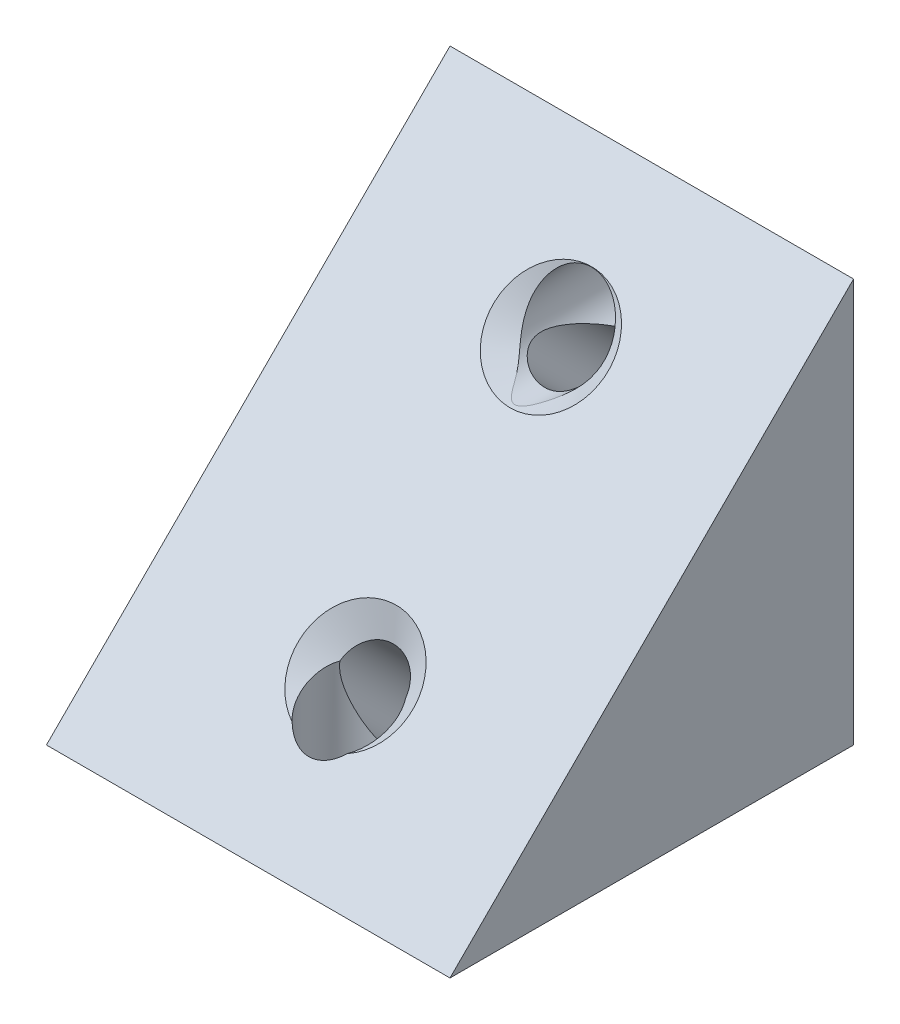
ISO-10303-21;
HEADER;
FILE_DESCRIPTION(('STEP AP214'),'2;1');
FILE_NAME('part.step','',(''),(''),'','','');
FILE_SCHEMA(('AUTOMOTIVE_DESIGN { 1 0 10303 214 1 1 1 1 }'));
ENDSEC;
DATA;
#1=APPLICATION_CONTEXT('core data for automotive mechanical design processes');
#2=APPLICATION_PROTOCOL_DEFINITION('international standard','automotive_design',2000,#1);
#3=PRODUCT_CONTEXT('',#1,'mechanical');
#4=PRODUCT('Part','Part','',(#3));
#5=PRODUCT_RELATED_PRODUCT_CATEGORY('part','',(#4));
#6=PRODUCT_DEFINITION_FORMATION('','',#4);
#7=PRODUCT_DEFINITION_CONTEXT('part definition',#1,'design');
#8=PRODUCT_DEFINITION('design','',#6,#7);
#9=PRODUCT_DEFINITION_SHAPE('','',#8);
#10=(LENGTH_UNIT() NAMED_UNIT(*) SI_UNIT(.MILLI.,.METRE.));
#11=(NAMED_UNIT(*) PLANE_ANGLE_UNIT() SI_UNIT($,.RADIAN.));
#12=(NAMED_UNIT(*) SI_UNIT($,.STERADIAN.) SOLID_ANGLE_UNIT());
#13=UNCERTAINTY_MEASURE_WITH_UNIT(LENGTH_MEASURE(1.E-05),#10,'distance_accuracy_value','');
#14=(GEOMETRIC_REPRESENTATION_CONTEXT(3) GLOBAL_UNCERTAINTY_ASSIGNED_CONTEXT((#13)) GLOBAL_UNIT_ASSIGNED_CONTEXT((#10,
#11,#12)) REPRESENTATION_CONTEXT('',''));
#15=CARTESIAN_POINT('',(0.,0.,0.));
#16=DIRECTION('',(0.,0.,1.));
#17=DIRECTION('',(1.,0.,0.));
#18=AXIS2_PLACEMENT_3D('',#15,#16,#17);
#19=CARTESIAN_POINT('',(-33.7186524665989,20.,20.));
#20=DIRECTION('',(1.,0.,0.));
#21=DIRECTION('',(0.,0.,-1.));
#22=AXIS2_PLACEMENT_3D('',#19,#20,#21);
#23=PLANE('',#22);
#24=DIRECTION('',(0.,0.,-1.));
#25=VECTOR('',#24,1.);
#26=CARTESIAN_POINT('',(-33.7186524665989,0.,20.));
#27=LINE('',#26,#25);
#28=CARTESIAN_POINT('',(-33.7186524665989,0.,20.));
#29=VERTEX_POINT('',#28);
#30=CARTESIAN_POINT('',(-33.7186524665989,0.,0.));
#31=VERTEX_POINT('',#30);
#32=EDGE_CURVE('E89',#29,#31,#27,.T.);
#33=ORIENTED_EDGE('',*,*,#32,.F.);
#34=DIRECTION('',(0.,0.707106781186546,-0.707106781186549));
#35=VECTOR('',#34,1.);
#36=CARTESIAN_POINT('',(-33.7186524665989,0.,20.));
#37=LINE('',#36,#35);
#38=CARTESIAN_POINT('',(-33.7186524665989,20.,0.));
#39=VERTEX_POINT('',#38);
#40=EDGE_CURVE('E85',#29,#39,#37,.T.);
#41=ORIENTED_EDGE('',*,*,#40,.T.);
#42=DIRECTION('',(0.,-1.,0.));
#43=VECTOR('',#42,1.);
#44=CARTESIAN_POINT('',(-33.7186524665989,20.,0.));
#45=LINE('',#44,#43);
#46=EDGE_CURVE('E87',#39,#31,#45,.T.);
#47=ORIENTED_EDGE('',*,*,#46,.T.);
#48=EDGE_LOOP('',(#33,#41,#47));
#49=FACE_BOUND('',#48,.T.);
#50=ADVANCED_FACE('F35',(#49),#23,.F.);
#51=CARTESIAN_POINT('',(-33.7186524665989,0.,20.));
#52=DIRECTION('',(0.,1.,0.));
#53=DIRECTION('',(0.,0.,1.));
#54=AXIS2_PLACEMENT_3D('',#51,#52,#53);
#55=PLANE('',#54);
#56=CARTESIAN_POINT('',(-23.7186524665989,0.,9.36909637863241));
#57=DIRECTION('',(0.,1.,0.));
#58=DIRECTION('',(0.,0.,1.));
#59=AXIS2_PLACEMENT_3D('',#56,#57,#58);
#60=ELLIPSE('',#59,2.30792582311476,1.63194999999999);
#61=CARTESIAN_POINT('',(-23.7186524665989,0.,11.6770222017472));
#62=VERTEX_POINT('',#61);
#63=EDGE_CURVE('E183',#62,#62,#60,.T.);
#64=ORIENTED_EDGE('',*,*,#63,.T.);
#65=EDGE_LOOP('',(#64));
#66=FACE_BOUND('',#65,.T.);
#67=CARTESIAN_POINT('',(-23.7186524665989,0.,15.));
#68=DIRECTION('',(0.,-1.,0.));
#69=DIRECTION('',(0.,0.,-1.));
#70=AXIS2_PLACEMENT_3D('',#67,#68,#69);
#71=CIRCLE('',#70,2.);
#72=CARTESIAN_POINT('',(-23.7186524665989,0.,13.));
#73=VERTEX_POINT('',#72);
#74=EDGE_CURVE('E115',#73,#73,#71,.T.);
#75=ORIENTED_EDGE('',*,*,#74,.F.);
#76=EDGE_LOOP('',(#75));
#77=FACE_BOUND('',#76,.T.);
#78=DIRECTION('',(1.,0.,0.));
#79=VECTOR('',#78,1.);
#80=CARTESIAN_POINT('',(-33.7186524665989,0.,0.));
#81=LINE('',#80,#79);
#82=CARTESIAN_POINT('',(-13.7186524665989,0.,0.));
#83=VERTEX_POINT('',#82);
#84=EDGE_CURVE('E100',#31,#83,#81,.T.);
#85=ORIENTED_EDGE('',*,*,#84,.T.);
#86=DIRECTION('',(0.,0.,-1.));
#87=VECTOR('',#86,1.);
#88=CARTESIAN_POINT('',(-13.7186524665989,0.,20.));
#89=LINE('',#88,#87);
#90=CARTESIAN_POINT('',(-13.7186524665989,0.,20.));
#91=VERTEX_POINT('',#90);
#92=EDGE_CURVE('E106',#91,#83,#89,.T.);
#93=ORIENTED_EDGE('',*,*,#92,.F.);
#94=DIRECTION('',(1.,0.,0.));
#95=VECTOR('',#94,1.);
#96=CARTESIAN_POINT('',(-33.7186524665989,0.,20.));
#97=LINE('',#96,#95);
#98=EDGE_CURVE('E103',#29,#91,#97,.T.);
#99=ORIENTED_EDGE('',*,*,#98,.F.);
#100=ORIENTED_EDGE('',*,*,#32,.T.);
#101=EDGE_LOOP('',(#85,#93,#99,#100));
#102=FACE_BOUND('',#101,.T.);
#103=ADVANCED_FACE('F160',(#66,#77,#102),#55,.F.);
#104=CARTESIAN_POINT('',(-13.7186524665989,20.,20.));
#105=DIRECTION('',(-1.,0.,0.));
#106=DIRECTION('',(0.,-1.,0.));
#107=AXIS2_PLACEMENT_3D('',#104,#105,#106);
#108=PLANE('',#107);
#109=DIRECTION('',(0.,1.,0.));
#110=VECTOR('',#109,1.);
#111=CARTESIAN_POINT('',(-13.7186524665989,20.,0.));
#112=LINE('',#111,#110);
#113=CARTESIAN_POINT('',(-13.7186524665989,20.,0.));
#114=VERTEX_POINT('',#113);
#115=EDGE_CURVE('E104',#83,#114,#112,.T.);
#116=ORIENTED_EDGE('',*,*,#115,.T.);
#117=DIRECTION('',(0.,-0.707106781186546,0.707106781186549));
#118=VECTOR('',#117,1.);
#119=CARTESIAN_POINT('',(-13.7186524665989,0.,20.));
#120=LINE('',#119,#118);
#121=EDGE_CURVE('E66',#114,#91,#120,.T.);
#122=ORIENTED_EDGE('',*,*,#121,.T.);
#123=ORIENTED_EDGE('',*,*,#92,.T.);
#124=EDGE_LOOP('',(#116,#122,#123));
#125=FACE_BOUND('',#124,.T.);
#126=ADVANCED_FACE('F164',(#125),#108,.F.);
#127=CARTESIAN_POINT('',(0.,0.,0.));
#128=DIRECTION('',(0.,0.,1.));
#129=DIRECTION('',(1.,0.,0.));
#130=AXIS2_PLACEMENT_3D('',#127,#128,#129);
#131=PLANE('',#130);
#132=CARTESIAN_POINT('',(-23.7186524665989,10.,0.));
#133=DIRECTION('',(0.,0.,1.));
#134=DIRECTION('',(0.,1.,0.));
#135=AXIS2_PLACEMENT_3D('',#132,#133,#134);
#136=ELLIPSE('',#135,2.30792582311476,1.63194999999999);
#137=CARTESIAN_POINT('',(-23.7186524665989,12.3079258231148,0.));
#138=VERTEX_POINT('',#137);
#139=EDGE_CURVE('E178',#138,#138,#136,.T.);
#140=ORIENTED_EDGE('',*,*,#139,.T.);
#141=EDGE_LOOP('',(#140));
#142=FACE_BOUND('',#141,.T.);
#143=CARTESIAN_POINT('',(-23.7186524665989,15.,0.));
#144=DIRECTION('',(0.,0.,-1.));
#145=DIRECTION('',(-1.,0.,0.));
#146=AXIS2_PLACEMENT_3D('',#143,#144,#145);
#147=CIRCLE('',#146,2.);
#148=CARTESIAN_POINT('',(-25.7186524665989,15.,0.));
#149=VERTEX_POINT('',#148);
#150=EDGE_CURVE('E181',#149,#149,#147,.T.);
#151=ORIENTED_EDGE('',*,*,#150,.F.);
#152=EDGE_LOOP('',(#151));
#153=FACE_BOUND('',#152,.T.);
#154=ORIENTED_EDGE('',*,*,#46,.F.);
#155=DIRECTION('',(-1.,0.,0.));
#156=VECTOR('',#155,1.);
#157=CARTESIAN_POINT('',(-33.7186524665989,20.,0.));
#158=LINE('',#157,#156);
#159=EDGE_CURVE('E99',#114,#39,#158,.T.);
#160=ORIENTED_EDGE('',*,*,#159,.F.);
#161=ORIENTED_EDGE('',*,*,#115,.F.);
#162=ORIENTED_EDGE('',*,*,#84,.F.);
#163=EDGE_LOOP('',(#154,#160,#161,#162));
#164=FACE_BOUND('',#163,.T.);
#165=ADVANCED_FACE('F97',(#142,#153,#164),#131,.F.);
#166=CARTESIAN_POINT('',(0.,0.,20.));
#167=DIRECTION('',(0.,0.707106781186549,0.707106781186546));
#168=DIRECTION('',(1.,0.,0.));
#169=AXIS2_PLACEMENT_3D('',#166,#167,#168);
#170=PLANE('',#169);
#171=CARTESIAN_POINT('',(-23.7186524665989,15.,4.99999999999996));
#172=DIRECTION('',(0.,0.707106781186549,0.707106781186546));
#173=DIRECTION('',(0.,-0.707106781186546,0.707106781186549));
#174=AXIS2_PLACEMENT_3D('',#171,#172,#173);
#175=CIRCLE('',#174,2.8575);
#176=CARTESIAN_POINT('',(-23.7186524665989,12.9794423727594,7.02055762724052));
#177=VERTEX_POINT('',#176);
#178=EDGE_CURVE('E149',#177,#177,#175,.T.);
#179=ORIENTED_EDGE('',*,*,#178,.F.);
#180=EDGE_LOOP('',(#179));
#181=FACE_BOUND('',#180,.T.);
#182=CARTESIAN_POINT('',(-23.7186524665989,5.3154518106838,14.6845481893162));
#183=DIRECTION('',(0.,0.707106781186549,0.707106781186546));
#184=DIRECTION('',(0.,-0.707106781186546,0.707106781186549));
#185=AXIS2_PLACEMENT_3D('',#182,#183,#184);
#186=CIRCLE('',#185,2.8575);
#187=CARTESIAN_POINT('',(-22.349830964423,3.54180670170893,16.4581932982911));
#188=VERTEX_POINT('',#187);
#189=CARTESIAN_POINT('',(-25.0874739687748,3.54180670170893,16.4581932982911));
#190=VERTEX_POINT('',#189);
#191=EDGE_CURVE('E57',#188,#190,#186,.T.);
#192=ORIENTED_EDGE('',*,*,#191,.F.);
#193=CARTESIAN_POINT('',(-23.7186524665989,4.99999999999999,15.));
#194=DIRECTION('',(0.,0.707106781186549,0.707106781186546));
#195=DIRECTION('',(0.,-0.707106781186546,0.707106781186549));
#196=AXIS2_PLACEMENT_3D('',#193,#194,#195);
#197=ELLIPSE('',#196,2.82842712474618,2.);
#198=EDGE_CURVE('E101',#190,#188,#197,.T.);
#199=ORIENTED_EDGE('',*,*,#198,.F.);
#200=EDGE_LOOP('',(#192,#199));
#201=FACE_BOUND('',#200,.T.);
#202=ORIENTED_EDGE('',*,*,#121,.F.);
#203=ORIENTED_EDGE('',*,*,#159,.T.);
#204=ORIENTED_EDGE('',*,*,#40,.F.);
#205=ORIENTED_EDGE('',*,*,#98,.T.);
#206=EDGE_LOOP('',(#202,#203,#204,#205));
#207=FACE_BOUND('',#206,.T.);
#208=ADVANCED_FACE('F37',(#181,#201,#207),#170,.T.);
#209=CARTESIAN_POINT('',(-23.7186524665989,10.,15.));
#210=DIRECTION('',(0.,-1.,0.));
#211=DIRECTION('',(0.,0.,-1.));
#212=AXIS2_PLACEMENT_3D('',#209,#210,#211);
#213=CYLINDRICAL_SURFACE('',#212,2.);
#214=ORIENTED_EDGE('',*,*,#198,.T.);
#215=CARTESIAN_POINT('',(-22.6736969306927,3.41779445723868,16.7053058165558));
#216=CARTESIAN_POINT('',(-22.624458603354,3.43297603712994,16.6751345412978));
#217=CARTESIAN_POINT('',(-22.5767835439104,3.44913908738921,16.6429862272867));
#218=CARTESIAN_POINT('',(-22.4848009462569,3.4832394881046,16.5750803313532));
#219=CARTESIAN_POINT('',(-22.4404913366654,3.50117573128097,16.5393250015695));
#220=CARTESIAN_POINT('',(-22.3132880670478,3.55721334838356,16.4274613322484));
#221=CARTESIAN_POINT('',(-22.2356472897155,3.59769162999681,16.3464617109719));
#222=CARTESIAN_POINT('',(-22.0960817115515,3.68327373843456,16.1745297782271));
#223=CARTESIAN_POINT('',(-22.0341229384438,3.72836726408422,16.0836195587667));
#224=CARTESIAN_POINT('',(-21.9263294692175,3.82184827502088,15.8941308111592));
#225=CARTESIAN_POINT('',(-21.8805120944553,3.87023923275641,15.7955441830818));
#226=CARTESIAN_POINT('',(-21.8020082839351,3.9735387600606,15.583476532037));
#227=CARTESIAN_POINT('',(-21.77097992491,4.02863012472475,15.4694697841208));
#228=CARTESIAN_POINT('',(-21.7293636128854,4.13914302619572,15.2378738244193));
#229=CARTESIAN_POINT('',(-21.7187879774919,4.19456474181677,15.1202824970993));
#230=CARTESIAN_POINT('',(-21.7185123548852,4.30652598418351,14.8779466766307));
#231=CARTESIAN_POINT('',(-21.7299498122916,4.3629687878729,14.7531537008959));
#232=CARTESIAN_POINT('',(-21.7765957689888,4.47082588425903,14.505812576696));
#233=CARTESIAN_POINT('',(-21.8117829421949,4.52224464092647,14.3832625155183));
#234=CARTESIAN_POINT('',(-21.8934450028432,4.60274076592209,14.1770013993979));
#235=CARTESIAN_POINT('',(-21.934159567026,4.63407440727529,14.0918729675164));
#236=CARTESIAN_POINT('',(-22.0285299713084,4.68917396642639,13.9264489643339));
#237=CARTESIAN_POINT('',(-22.0821656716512,4.71295152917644,13.8461461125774));
#238=CARTESIAN_POINT('',(-22.1868041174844,4.74457788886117,13.7120810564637));
#239=CARTESIAN_POINT('',(-22.2350314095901,4.75493602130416,13.6567490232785));
#240=CARTESIAN_POINT('',(-22.3378571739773,4.76715166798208,13.5512769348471));
#241=CARTESIAN_POINT('',(-22.3924465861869,4.76902112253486,13.5011296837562));
#242=CARTESIAN_POINT('',(-22.4966950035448,4.7624325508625,13.415524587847));
#243=CARTESIAN_POINT('',(-22.5455967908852,4.75568872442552,13.3790219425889));
#244=CARTESIAN_POINT('',(-22.6451340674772,4.73350113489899,13.3114607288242));
#245=CARTESIAN_POINT('',(-22.6957674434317,4.71806764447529,13.2803957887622));
#246=CARTESIAN_POINT('',(-22.7968266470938,4.67806049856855,13.2241643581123));
#247=CARTESIAN_POINT('',(-22.8472519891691,4.65347167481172,13.1990077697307));
#248=CARTESIAN_POINT('',(-22.945829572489,4.59587308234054,13.1545515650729));
#249=CARTESIAN_POINT('',(-22.9939795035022,4.56285496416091,13.1352577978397));
#250=CARTESIAN_POINT('',(-23.1019428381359,4.47791902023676,13.0963254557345));
#251=CARTESIAN_POINT('',(-23.1603699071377,4.4233587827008,13.0786691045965));
#252=CARTESIAN_POINT('',(-23.2701059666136,4.30599858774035,13.0501172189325));
#253=CARTESIAN_POINT('',(-23.3213988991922,4.24318064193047,13.0392367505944));
#254=CARTESIAN_POINT('',(-23.4018328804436,4.13376293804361,13.0249829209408));
#255=CARTESIAN_POINT('',(-23.4327324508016,4.08857785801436,13.0203181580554));
#256=CARTESIAN_POINT('',(-23.4920194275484,3.99644888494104,13.0126565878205));
#257=CARTESIAN_POINT('',(-23.5204064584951,3.94950473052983,13.0096600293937));
#258=CARTESIAN_POINT('',(-23.5692630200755,3.86456313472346,13.005470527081));
#259=CARTESIAN_POINT('',(-23.5901269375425,3.82680080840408,13.0040288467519));
#260=CARTESIAN_POINT('',(-23.6230944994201,3.76562470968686,13.0022448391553));
#261=CARTESIAN_POINT('',(-23.6354464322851,3.74234822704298,13.0016930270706));
#262=CARTESIAN_POINT('',(-23.6554360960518,3.70495220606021,13.0009849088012));
#263=CARTESIAN_POINT('',(-23.6630283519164,3.6908114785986,13.0007583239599));
#264=CARTESIAN_POINT('',(-23.6756828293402,3.66822028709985,13.0004558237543));
#265=CARTESIAN_POINT('',(-23.6805889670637,3.6596825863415,13.0003555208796));
#266=CARTESIAN_POINT('',(-23.6890483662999,3.64611731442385,13.0002164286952));
#267=CARTESIAN_POINT('',(-23.6924130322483,3.64098153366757,13.0001687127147));
#268=CARTESIAN_POINT('',(-23.6979533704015,3.63359893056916,13.0001062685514));
#269=CARTESIAN_POINT('',(-23.6998964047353,3.63117715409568,13.0000868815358));
#270=CARTESIAN_POINT('',(-23.704074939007,3.62659775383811,13.0000520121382));
#271=CARTESIAN_POINT('',(-23.7063078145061,3.62443806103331,13.0000364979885));
#272=CARTESIAN_POINT('',(-23.7096139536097,3.62209072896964,13.0000202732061));
#273=CARTESIAN_POINT('',(-23.7104373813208,3.62156377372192,13.0000166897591));
#274=CARTESIAN_POINT('',(-23.7121489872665,3.6206276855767,13.0000103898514));
#275=CARTESIAN_POINT('',(-23.7130370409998,3.62021833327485,13.0000076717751));
#276=CARTESIAN_POINT('',(-23.7146873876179,3.61963083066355,13.0000037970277));
#277=CARTESIAN_POINT('',(-23.7154387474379,3.61942265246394,13.0000024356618));
#278=CARTESIAN_POINT('',(-23.7169659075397,3.61913613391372,13.0000005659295));
#279=CARTESIAN_POINT('',(-23.7177416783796,3.61905764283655,13.0000000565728));
#280=CARTESIAN_POINT('',(-23.7192967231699,3.61904160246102,12.9999999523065));
#281=CARTESIAN_POINT('',(-23.7200760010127,3.61910441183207,13.0000003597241));
#282=CARTESIAN_POINT('',(-23.7216122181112,3.61936239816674,13.0000020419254));
#283=CARTESIAN_POINT('',(-23.7223691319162,3.61955772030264,13.0000033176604));
#284=CARTESIAN_POINT('',(-23.7241447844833,3.62015809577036,13.0000072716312));
#285=CARTESIAN_POINT('',(-23.7251452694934,3.62061607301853,13.0000103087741));
#286=CARTESIAN_POINT('',(-23.7270652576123,3.6216782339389,13.0000174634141));
#287=CARTESIAN_POINT('',(-23.7279844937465,3.62228287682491,13.0000215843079));
#288=CARTESIAN_POINT('',(-23.7313192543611,3.62473191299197,13.0000385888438));
#289=CARTESIAN_POINT('',(-23.7335056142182,3.62687754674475,13.0000540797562));
#290=CARTESIAN_POINT('',(-23.7376056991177,3.63141698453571,13.0000887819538));
#291=CARTESIAN_POINT('',(-23.7395169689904,3.63381272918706,13.0001080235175));
#292=CARTESIAN_POINT('',(-23.7454628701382,3.6417590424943,13.0001754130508));
#293=CARTESIAN_POINT('',(-23.7491916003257,3.64753778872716,13.0002298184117));
#294=CARTESIAN_POINT('',(-23.756386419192,3.659257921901,13.0003528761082));
#295=CARTESIAN_POINT('',(-23.7598518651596,3.66519966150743,13.0004215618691));
#296=CARTESIAN_POINT('',(-23.7700384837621,3.68309241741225,13.0006485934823));
#297=CARTESIAN_POINT('',(-23.7765747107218,3.69515054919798,13.0008282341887));
#298=CARTESIAN_POINT('',(-23.792622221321,3.72500914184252,13.001345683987));
#299=CARTESIAN_POINT('',(-23.8020820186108,3.74283442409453,13.001718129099));
#300=CARTESIAN_POINT('',(-23.8211017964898,3.77843845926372,13.0026030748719));
#301=CARTESIAN_POINT('',(-23.8306618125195,3.79621719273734,13.0031156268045));
#302=CARTESIAN_POINT('',(-23.8596672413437,3.84941942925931,13.0048831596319));
#303=CARTESIAN_POINT('',(-23.8794180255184,3.88467015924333,13.0063674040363));
#304=CARTESIAN_POINT('',(-23.9262143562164,3.96501113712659,13.0106220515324));
#305=CARTESIAN_POINT('',(-23.9536614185,4.00985753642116,13.0136455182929));
#306=CARTESIAN_POINT('',(-24.0109119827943,4.09792002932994,13.0212582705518));
#307=CARTESIAN_POINT('',(-24.0407162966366,4.14113555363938,13.0258480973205));
#308=CARTESIAN_POINT('',(-24.1029330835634,4.22526155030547,13.0370111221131));
#309=CARTESIAN_POINT('',(-24.1353398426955,4.26617675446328,13.0435800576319));
#310=CARTESIAN_POINT('',(-24.2030281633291,4.34503108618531,13.0592305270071));
#311=CARTESIAN_POINT('',(-24.2383082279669,4.38297174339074,13.0683107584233));
#312=CARTESIAN_POINT('',(-24.3197871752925,4.46275207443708,13.0919109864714));
#313=CARTESIAN_POINT('',(-24.3666989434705,4.50366507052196,13.1071821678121));
#314=CARTESIAN_POINT('',(-24.4642704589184,4.57772905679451,13.1434579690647));
#315=CARTESIAN_POINT('',(-24.5149247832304,4.61089099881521,13.1644544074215));
#316=CARTESIAN_POINT('',(-24.6187728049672,4.66804680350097,13.2130806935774));
#317=CARTESIAN_POINT('',(-24.6719814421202,4.69197671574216,13.2407547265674));
#318=CARTESIAN_POINT('',(-24.7782097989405,4.72976381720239,13.3026155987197));
#319=CARTESIAN_POINT('',(-24.8312294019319,4.74361559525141,13.3368059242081));
#320=CARTESIAN_POINT('',(-24.9307560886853,4.76129295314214,13.4080623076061));
#321=CARTESIAN_POINT('',(-24.9774505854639,4.76580697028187,13.4447057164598));
#322=CARTESIAN_POINT('',(-25.0674628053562,4.7680942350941,13.5220817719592));
#323=CARTESIAN_POINT('',(-25.110778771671,4.76586399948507,13.5628165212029));
#324=CARTESIAN_POINT('',(-25.2137265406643,4.75348563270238,13.6686241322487));
#325=CARTESIAN_POINT('',(-25.2708291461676,4.73996631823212,13.7357681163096));
#326=CARTESIAN_POINT('',(-25.3748700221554,4.70435499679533,13.8754651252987));
#327=CARTESIAN_POINT('',(-25.4217844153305,4.68224318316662,13.9480303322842));
#328=CARTESIAN_POINT('',(-25.5181647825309,4.62428107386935,14.1200852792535));
#329=CARTESIAN_POINT('',(-25.5639060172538,4.58629678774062,14.2209431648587));
#330=CARTESIAN_POINT('',(-25.6377478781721,4.5041081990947,14.4264013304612));
#331=CARTESIAN_POINT('',(-25.6658394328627,4.45990071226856,14.5310035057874));
#332=CARTESIAN_POINT('',(-25.7051020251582,4.36716253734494,14.7433890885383));
#333=CARTESIAN_POINT('',(-25.7160078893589,4.31857610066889,14.8511966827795));
#334=CARTESIAN_POINT('',(-25.7204468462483,4.2196931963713,15.0663360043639));
#335=CARTESIAN_POINT('',(-25.7139803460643,4.16939676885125,15.1736677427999));
#336=CARTESIAN_POINT('',(-25.6819427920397,4.06181502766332,15.4004002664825));
#337=CARTESIAN_POINT('',(-25.6538853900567,4.00451250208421,15.5194495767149));
#338=CARTESIAN_POINT('',(-25.5761597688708,3.89185772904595,15.751424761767));
#339=CARTESIAN_POINT('',(-25.5264714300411,3.83650734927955,15.8643448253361));
#340=CARTESIAN_POINT('',(-25.4057023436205,3.7294966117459,16.0813922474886));
#341=CARTESIAN_POINT('',(-25.33446607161,3.67786657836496,16.1854483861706));
#342=CARTESIAN_POINT('',(-25.1719602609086,3.5810625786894,16.3797990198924));
#343=CARTESIAN_POINT('',(-25.0807482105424,3.53587068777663,16.4701317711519));
#344=CARTESIAN_POINT('',(-24.9465199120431,3.48110254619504,16.5793345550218));
#345=CARTESIAN_POINT('',(-24.9112856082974,3.46765874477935,16.6061140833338));
#346=CARTESIAN_POINT('',(-24.8388811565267,3.44188057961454,16.6574223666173));
#347=CARTESIAN_POINT('',(-24.8017127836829,3.42954522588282,16.6819531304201));
#348=CARTESIAN_POINT('',(-24.7636080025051,3.41779445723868,16.7053058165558));
#349=B_SPLINE_CURVE_WITH_KNOTS('',3,(#215,#216,#217,#218,#219,#220,#221,#222,#223,#224,#225,
#226,#227,#228,#229,#230,#231,#232,#233,#234,#235,#236,#237,#238,#239,#240,#241,#242,#243,#244,
#245,#246,#247,#248,#249,#250,#251,#252,#253,#254,#255,#256,#257,#258,#259,#260,#261,#262,#263,
#264,#265,#266,#267,#268,#269,#270,#271,#272,#273,#274,#275,#276,#277,#278,#279,#280,#281,#282,
#283,#284,#285,#286,#287,#288,#289,#290,#291,#292,#293,#294,#295,#296,#297,#298,#299,#300,#301,
#302,#303,#304,#305,#306,#307,#308,#309,#310,#311,#312,#313,#314,#315,#316,#317,#318,#319,#320,
#321,#322,#323,#324,#325,#326,#327,#328,#329,#330,#331,#332,#333,#334,#335,#336,#337,#338,#339,
#340,#341,#342,#343,#344,#345,#346,#347,#348),.UNSPECIFIED.,.F.,.F.,(4,2,2,2,2,2,2,2,2,2,2,2,2,
2,2,2,2,2,2,2,2,2,2,2,2,2,2,2,2,2,2,2,2,2,2,2,2,2,2,2,2,2,2,2,2,2,2,2,2,2,2,2,2,2,2,2,2,2,2,2,2,
2,2,2,2,2,4),(0.,0.178993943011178,0.357876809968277,0.713938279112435,1.0692216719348,
1.42488516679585,1.81429002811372,2.20392933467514,2.61424305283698,3.0241888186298,
3.32146410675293,3.61827900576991,3.83989779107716,4.06120474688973,4.24460275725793,
4.42778441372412,4.61127092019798,4.79493988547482,5.03914423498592,5.28388965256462,
5.44859381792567,5.61332255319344,5.74280145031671,5.8218730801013,5.87002207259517,
5.89956445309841,5.91795268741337,5.9272666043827,5.93650140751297,5.93942767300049,
5.94234844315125,5.94467795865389,5.94700476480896,5.94933748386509,5.95167276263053,
5.95495475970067,5.95824716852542,5.96736286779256,5.97655545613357,5.99714720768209,
6.01778771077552,6.05892868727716,6.11948236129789,6.18005822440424,6.30134091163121,
6.45925494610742,6.61722360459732,6.77485444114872,6.9324036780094,7.12396722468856,
7.31525844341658,7.50785191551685,7.70054871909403,7.87844332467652,8.0564298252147,
8.32246629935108,8.58911968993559,8.93850851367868,9.2880767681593,9.64298778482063,
9.99789048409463,10.4012182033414,10.8049218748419,11.2116118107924,11.6171463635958,
11.7558208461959,11.8943702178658),.UNSPECIFIED.);
#350=CARTESIAN_POINT('',(-22.0967021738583,4.71584259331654,13.8298387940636));
#351=VERTEX_POINT('',#350);
#352=EDGE_CURVE('E11',#188,#351,#349,.T.);
#353=ORIENTED_EDGE('',*,*,#352,.T.);
#354=CARTESIAN_POINT('',(-22.0967021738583,4.71584259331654,13.8298387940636));
#355=CARTESIAN_POINT('',(-22.0936194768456,4.68087088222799,13.8341198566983));
#356=CARTESIAN_POINT('',(-22.0913193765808,4.64572696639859,13.837334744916));
#357=CARTESIAN_POINT('',(-22.0880972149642,4.57529344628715,13.84185428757));
#358=CARTESIAN_POINT('',(-22.0871734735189,4.54000407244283,13.8431612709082));
#359=CARTESIAN_POINT('',(-22.0861822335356,4.43446607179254,13.8445590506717));
#360=CARTESIAN_POINT('',(-22.0878657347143,4.3641683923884,13.8421677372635));
#361=CARTESIAN_POINT('',(-22.0947985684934,4.2248340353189,13.8324689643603));
#362=CARTESIAN_POINT('',(-22.1000138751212,4.15579172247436,13.825208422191));
#363=CARTESIAN_POINT('',(-22.1133345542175,4.01836686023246,13.8070702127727));
#364=CARTESIAN_POINT('',(-22.1214448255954,3.94998563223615,13.7961864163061));
#365=CARTESIAN_POINT('',(-22.1475720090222,3.76007704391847,13.7620734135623));
#366=CARTESIAN_POINT('',(-22.1683417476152,3.63946237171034,13.735903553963));
#367=CARTESIAN_POINT('',(-22.2169181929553,3.40091617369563,13.6785556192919));
#368=CARTESIAN_POINT('',(-22.2447264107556,3.28298522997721,13.6473764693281));
#369=CARTESIAN_POINT('',(-22.3077325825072,3.04893121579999,13.5817637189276));
#370=CARTESIAN_POINT('',(-22.3429888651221,2.93283068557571,13.5473056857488));
#371=CARTESIAN_POINT('',(-22.421488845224,2.70390914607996,13.4767919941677));
#372=CARTESIAN_POINT('',(-22.4647271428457,2.59108597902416,13.4407374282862));
#373=CARTESIAN_POINT('',(-22.5402313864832,2.41692868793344,13.3836747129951));
#374=CARTESIAN_POINT('',(-22.5693094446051,2.35416151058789,13.3628091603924));
#375=CARTESIAN_POINT('',(-22.6310251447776,2.23037767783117,13.321174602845));
#376=CARTESIAN_POINT('',(-22.6636616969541,2.16936049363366,13.3004055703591));
#377=CARTESIAN_POINT('',(-22.7328555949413,2.04993112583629,13.2593639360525));
#378=CARTESIAN_POINT('',(-22.7693881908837,1.99150548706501,13.2390891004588));
#379=CARTESIAN_POINT('',(-22.8472446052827,1.87770152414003,13.1992886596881));
#380=CARTESIAN_POINT('',(-22.8885639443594,1.82232042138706,13.1797623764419));
#381=CARTESIAN_POINT('',(-22.9700893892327,1.72413450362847,13.144926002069));
#382=CARTESIAN_POINT('',(-23.0094672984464,1.68071407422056,13.1294327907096));
#383=CARTESIAN_POINT('',(-23.0931335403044,1.59807217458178,13.0998159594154));
#384=CARTESIAN_POINT('',(-23.1374321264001,1.55885982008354,13.0856953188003));
#385=CARTESIAN_POINT('',(-23.2322092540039,1.4861559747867,13.0594252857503));
#386=CARTESIAN_POINT('',(-23.2827667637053,1.45275382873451,13.0473068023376));
#387=CARTESIAN_POINT('',(-23.3896623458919,1.39554639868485,13.0265035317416));
#388=CARTESIAN_POINT('',(-23.4459735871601,1.371698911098,13.017803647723));
#389=CARTESIAN_POINT('',(-23.5424953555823,1.34322507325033,13.0074049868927));
#390=CARTESIAN_POINT('',(-23.5814317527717,1.334791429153,13.0043211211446));
#391=CARTESIAN_POINT('',(-23.6602684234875,1.32424622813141,13.0004643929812));
#392=CARTESIAN_POINT('',(-23.7001679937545,1.3221301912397,12.9996898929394));
#393=CARTESIAN_POINT('',(-23.7797604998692,1.32444611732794,13.0005372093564));
#394=CARTESIAN_POINT('',(-23.8194533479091,1.32888066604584,13.002159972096));
#395=CARTESIAN_POINT('',(-23.8975123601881,1.34383820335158,13.0076282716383));
#396=CARTESIAN_POINT('',(-23.9358773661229,1.35436637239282,13.0114756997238));
#397=CARTESIAN_POINT('',(-24.0229964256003,1.38500012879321,13.0226543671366));
#398=CARTESIAN_POINT('',(-24.070937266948,1.40713064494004,13.0307201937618));
#399=CARTESIAN_POINT('',(-24.1624788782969,1.4582628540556,13.0493044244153));
#400=CARTESIAN_POINT('',(-24.2060683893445,1.48728174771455,13.0598289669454));
#401=CARTESIAN_POINT('',(-24.3167687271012,1.57124696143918,13.0901758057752));
#402=CARTESIAN_POINT('',(-24.3801149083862,1.63055417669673,13.1115091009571));
#403=CARTESIAN_POINT('',(-24.4971134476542,1.75703244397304,13.1566521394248));
#404=CARTESIAN_POINT('',(-24.5507480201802,1.82421755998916,13.1804663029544));
#405=CARTESIAN_POINT('',(-24.6522183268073,1.966242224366,13.2303215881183));
#406=CARTESIAN_POINT('',(-24.699752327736,2.04127662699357,13.2564131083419));
#407=CARTESIAN_POINT('',(-24.7881568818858,2.19502415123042,13.3091987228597));
#408=CARTESIAN_POINT('',(-24.8290197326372,2.27374139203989,13.3358934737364));
#409=CARTESIAN_POINT('',(-24.9054461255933,2.43440551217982,13.3894994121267));
#410=CARTESIAN_POINT('',(-24.9409674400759,2.51637224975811,13.4164107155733));
#411=CARTESIAN_POINT('',(-25.0071389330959,2.68240496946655,13.4697691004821));
#412=CARTESIAN_POINT('',(-25.0377877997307,2.76647150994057,13.4962160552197));
#413=CARTESIAN_POINT('',(-25.1079206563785,2.97561954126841,13.5601689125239));
#414=CARTESIAN_POINT('',(-25.1449385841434,3.10169501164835,13.5971349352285));
#415=CARTESIAN_POINT('',(-25.21067024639,3.35736746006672,13.6672659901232));
#416=CARTESIAN_POINT('',(-25.2393659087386,3.48697144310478,13.7004226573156));
#417=CARTESIAN_POINT('',(-25.2757659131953,3.68273799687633,13.7447080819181));
#418=CARTESIAN_POINT('',(-25.2867312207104,3.74770519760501,13.7584743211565));
#419=CARTESIAN_POINT('',(-25.306410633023,3.87840937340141,13.7837434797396));
#420=CARTESIAN_POINT('',(-25.3151254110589,3.94414611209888,13.7952470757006));
#421=CARTESIAN_POINT('',(-25.3300000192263,4.07614879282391,13.8152158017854));
#422=CARTESIAN_POINT('',(-25.3361683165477,4.14241222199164,13.8236909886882));
#423=CARTESIAN_POINT('',(-25.3455060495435,4.27551988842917,13.8366366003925));
#424=CARTESIAN_POINT('',(-25.3486786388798,4.3423634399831,13.8411112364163));
#425=CARTESIAN_POINT('',(-25.3504547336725,4.434822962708,13.8436173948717));
#426=CARTESIAN_POINT('',(-25.3506707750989,4.46035436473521,13.8439225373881));
#427=CARTESIAN_POINT('',(-25.3504958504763,4.51141364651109,13.8436746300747));
#428=CARTESIAN_POINT('',(-25.3501048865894,4.53694152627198,13.8431215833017));
#429=CARTESIAN_POINT('',(-25.347910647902,4.61376274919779,13.8400353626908));
#430=CARTESIAN_POINT('',(-25.3450781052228,4.66496928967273,13.8360641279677));
#431=CARTESIAN_POINT('',(-25.3406027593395,4.71584259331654,13.8298387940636));
#432=B_SPLINE_CURVE_WITH_KNOTS('',3,(#354,#355,#356,#357,#358,#359,#360,#361,#362,#363,#364,
#365,#366,#367,#368,#369,#370,#371,#372,#373,#374,#375,#376,#377,#378,#379,#380,#381,#382,#383,
#384,#385,#386,#387,#388,#389,#390,#391,#392,#393,#394,#395,#396,#397,#398,#399,#400,#401,#402,
#403,#404,#405,#406,#407,#408,#409,#410,#411,#412,#413,#414,#415,#416,#417,#418,#419,#420,#421,
#422,#423,#424,#425,#426,#427,#428,#429,#430,#431),.UNSPECIFIED.,.F.,.F.,(4,2,2,2,2,2,2,2,2,2,2,
2,2,2,2,2,2,2,2,2,2,2,2,2,2,2,2,2,2,2,2,2,2,2,2,2,2,2,4),(0.,0.106035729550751,
0.211941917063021,0.422614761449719,0.631286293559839,0.840312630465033,1.21530862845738,
1.59038520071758,1.96851591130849,2.34639174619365,2.56306777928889,2.77967763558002,
2.99498531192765,3.2100931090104,3.39171148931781,3.57371567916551,3.75830969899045,
3.94207911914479,4.06144065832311,4.18071753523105,4.30004150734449,4.41946707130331,
4.57880668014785,4.73854843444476,5.00511812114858,5.27217116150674,5.54947824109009,
5.82710326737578,6.10681913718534,6.38661019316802,6.79575187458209,7.20577548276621,
7.40764247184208,7.60944900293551,7.8105790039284,8.0114970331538,8.08808262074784,
8.16466793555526,8.31880848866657),.UNSPECIFIED.);
#433=CARTESIAN_POINT('',(-25.3406027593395,4.71584259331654,13.8298387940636));
#434=VERTEX_POINT('',#433);
#435=EDGE_CURVE('E48',#351,#434,#432,.T.);
#436=ORIENTED_EDGE('',*,*,#435,.T.);
#437=EDGE_CURVE('E50',#434,#190,#349,.T.);
#438=ORIENTED_EDGE('',*,*,#437,.T.);
#439=EDGE_LOOP('',(#214,#353,#436,#438));
#440=FACE_BOUND('',#439,.T.);
#441=ORIENTED_EDGE('',*,*,#74,.T.);
#442=EDGE_LOOP('',(#441));
#443=FACE_BOUND('',#442,.T.);
#444=ADVANCED_FACE('F126',(#440,#443),#213,.F.);
#445=CARTESIAN_POINT('',(-23.7186524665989,15.,10.));
#446=DIRECTION('',(0.,0.,-1.));
#447=DIRECTION('',(-1.,0.,0.));
#448=AXIS2_PLACEMENT_3D('',#445,#446,#447);
#449=CYLINDRICAL_SURFACE('',#448,2.);
#450=CARTESIAN_POINT('',(-23.7186524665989,13.,5.30792582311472));
#451=CARTESIAN_POINT('',(-23.8101174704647,12.9999980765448,5.3079259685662));
#452=CARTESIAN_POINT('',(-23.9015671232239,13.0063040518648,5.30332917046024));
#453=CARTESIAN_POINT('',(-24.0818035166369,13.0311447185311,5.28491193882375));
#454=CARTESIAN_POINT('',(-24.1705912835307,13.049674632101,5.27109510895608));
#455=CARTESIAN_POINT('',(-24.3429855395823,13.0978406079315,5.2340988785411));
#456=CARTESIAN_POINT('',(-24.4265954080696,13.1274693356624,5.21092566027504));
#457=CARTESIAN_POINT('',(-24.5864887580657,13.1959942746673,5.15480539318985));
#458=CARTESIAN_POINT('',(-24.6627656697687,13.2348986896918,5.12184968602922));
#459=CARTESIAN_POINT('',(-24.806400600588,13.3195912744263,5.04500317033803));
#460=CARTESIAN_POINT('',(-24.8736892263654,13.3654277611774,5.00103406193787));
#461=CARTESIAN_POINT('',(-24.9657150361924,13.4359200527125,4.9260342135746));
#462=CARTESIAN_POINT('',(-24.9948990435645,13.4597003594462,4.89953501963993));
#463=CARTESIAN_POINT('',(-25.0500729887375,13.5071375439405,4.84331279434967));
#464=CARTESIAN_POINT('',(-25.0760644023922,13.5307944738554,4.81359126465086));
#465=CARTESIAN_POINT('',(-25.1348272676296,13.5869473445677,4.73751066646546));
#466=CARTESIAN_POINT('',(-25.1658492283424,13.6189736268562,4.68941348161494));
#467=CARTESIAN_POINT('',(-25.2202592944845,13.6783319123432,4.58657880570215));
#468=CARTESIAN_POINT('',(-25.2436626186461,13.7056732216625,4.53185485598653));
#469=CARTESIAN_POINT('',(-25.2829122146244,13.7533798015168,4.41679860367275));
#470=CARTESIAN_POINT('',(-25.2987451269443,13.7737327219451,4.35645660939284));
#471=CARTESIAN_POINT('',(-25.323590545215,13.8064368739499,4.23229856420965));
#472=CARTESIAN_POINT('',(-25.332594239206,13.8187777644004,4.16847813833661));
#473=CARTESIAN_POINT('',(-25.348106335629,13.8401904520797,4.00833149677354));
#474=CARTESIAN_POINT('',(-25.3513314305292,13.8448346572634,3.91113547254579));
#475=CARTESIAN_POINT('',(-25.3496048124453,13.8424374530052,3.71690834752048));
#476=CARTESIAN_POINT('',(-25.3446186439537,13.8353468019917,3.61987966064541));
#477=CARTESIAN_POINT('',(-25.3279212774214,13.8123657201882,3.41736615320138));
#478=CARTESIAN_POINT('',(-25.3155711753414,13.7956452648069,3.31203795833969));
#479=CARTESIAN_POINT('',(-25.2851284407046,13.756307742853,3.10327326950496));
#480=CARTESIAN_POINT('',(-25.2670286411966,13.7336833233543,2.99983930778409));
#481=CARTESIAN_POINT('',(-25.2255588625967,13.6846024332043,2.79469054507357));
#482=CARTESIAN_POINT('',(-25.2021757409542,13.6581364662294,2.6929807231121));
#483=CARTESIAN_POINT('',(-25.1501806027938,13.6027988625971,2.49165092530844));
#484=CARTESIAN_POINT('',(-25.1215720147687,13.573928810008,2.39202962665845));
#485=CARTESIAN_POINT('',(-25.0634459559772,13.519163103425,2.20980025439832));
#486=CARTESIAN_POINT('',(-25.0347087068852,13.4934709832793,2.12688194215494));
#487=CARTESIAN_POINT('',(-24.9727321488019,13.4415002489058,1.96293743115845));
#488=CARTESIAN_POINT('',(-24.9394936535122,13.4152217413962,1.88191089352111));
#489=CARTESIAN_POINT('',(-24.8680120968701,13.3626441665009,1.72256838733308));
#490=CARTESIAN_POINT('',(-24.8297925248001,13.3363457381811,1.64424175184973));
#491=CARTESIAN_POINT('',(-24.7473150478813,13.2841210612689,1.49074434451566));
#492=CARTESIAN_POINT('',(-24.7030625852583,13.2581945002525,1.41557080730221));
#493=CARTESIAN_POINT('',(-24.6179956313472,13.2131193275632,1.28620874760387));
#494=CARTESIAN_POINT('',(-24.5786691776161,13.1937645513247,1.23112092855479));
#495=CARTESIAN_POINT('',(-24.4946130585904,13.1560877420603,1.12458026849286));
#496=CARTESIAN_POINT('',(-24.4498727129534,13.1377678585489,1.07313494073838));
#497=CARTESIAN_POINT('',(-24.3534505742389,13.1027116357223,0.975200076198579));
#498=CARTESIAN_POINT('',(-24.3016937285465,13.0859963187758,0.928775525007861));
#499=CARTESIAN_POINT('',(-24.1906162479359,13.0556407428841,0.844793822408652));
#500=CARTESIAN_POINT('',(-24.1313267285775,13.0419884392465,0.807201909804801));
#501=CARTESIAN_POINT('',(-24.0308256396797,13.02414841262,0.758194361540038));
#502=CARTESIAN_POINT('',(-23.9920729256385,13.0183698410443,0.742351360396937));
#503=CARTESIAN_POINT('',(-23.9123627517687,13.0090001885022,0.716685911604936));
#504=CARTESIAN_POINT('',(-23.8714079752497,13.0054065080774,0.70685630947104));
#505=CARTESIAN_POINT('',(-23.787971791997,13.0007628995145,0.694158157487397));
#506=CARTESIAN_POINT('',(-23.7454818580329,12.999730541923,0.69133768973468));
#507=CARTESIAN_POINT('',(-23.6606772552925,13.0003907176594,0.693142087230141));
#508=CARTESIAN_POINT('',(-23.6183626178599,13.0020837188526,0.697768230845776));
#509=CARTESIAN_POINT('',(-23.5385943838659,13.0077514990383,0.713271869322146));
#510=CARTESIAN_POINT('',(-23.5010212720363,13.011534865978,0.723625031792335));
#511=CARTESIAN_POINT('',(-23.4278765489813,13.0209064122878,0.74930631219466));
#512=CARTESIAN_POINT('',(-23.3923058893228,13.0264954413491,0.764636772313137));
#513=CARTESIAN_POINT('',(-23.3016047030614,13.0431277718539,0.810342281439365));
#514=CARTESIAN_POINT('',(-23.2484039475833,13.0553804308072,0.844087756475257));
#515=CARTESIAN_POINT('',(-23.1480780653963,13.0824067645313,0.918832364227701));
#516=CARTESIAN_POINT('',(-23.1009727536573,13.0971883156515,0.959854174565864));
#517=CARTESIAN_POINT('',(-23.0157531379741,13.1270883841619,1.0432543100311));
#518=CARTESIAN_POINT('',(-22.977220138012,13.1420836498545,1.08525661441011));
#519=CARTESIAN_POINT('',(-22.9040612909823,13.1729752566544,1.1722576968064));
#520=CARTESIAN_POINT('',(-22.8694389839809,13.1888723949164,1.21725913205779));
#521=CARTESIAN_POINT('',(-22.8035111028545,13.2212735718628,1.30956475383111));
#522=CARTESIAN_POINT('',(-22.7722131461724,13.2377788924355,1.35687388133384));
#523=CARTESIAN_POINT('',(-22.7125680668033,13.2711394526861,1.45320834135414));
#524=CARTESIAN_POINT('',(-22.6842220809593,13.287994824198,1.50223432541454));
#525=CARTESIAN_POINT('',(-22.5985225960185,13.3416513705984,1.65965393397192));
#526=CARTESIAN_POINT('',(-22.5459340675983,13.3787675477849,1.77054289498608));
#527=CARTESIAN_POINT('',(-22.4503068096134,13.4524462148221,1.99660512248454));
#528=CARTESIAN_POINT('',(-22.4072803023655,13.4890079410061,2.11178365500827));
#529=CARTESIAN_POINT('',(-22.3293775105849,13.5603133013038,2.34541554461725));
#530=CARTESIAN_POINT('',(-22.2945018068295,13.5950568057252,2.46386913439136));
#531=CARTESIAN_POINT('',(-22.2322158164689,13.6611353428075,2.70353163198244));
#532=CARTESIAN_POINT('',(-22.2047989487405,13.6924733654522,2.82473800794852));
#533=CARTESIAN_POINT('',(-22.1589389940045,13.747606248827,3.06212089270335));
#534=CARTESIAN_POINT('',(-22.1400324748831,13.7717564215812,3.17812013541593));
#535=CARTESIAN_POINT('',(-22.117332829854,13.8016952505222,3.35389701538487));
#536=CARTESIAN_POINT('',(-22.1107106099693,13.8106256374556,3.41277032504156));
#537=CARTESIAN_POINT('',(-22.0996389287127,13.8257418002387,3.53106250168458));
#538=CARTESIAN_POINT('',(-22.0951888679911,13.8319283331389,3.59048121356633));
#539=CARTESIAN_POINT('',(-22.0875021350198,13.8426690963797,3.73533386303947));
#540=CARTESIAN_POINT('',(-22.0856026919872,13.8453876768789,3.82100429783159));
#541=CARTESIAN_POINT('',(-22.0890380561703,13.8405202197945,3.99191322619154));
#542=CARTESIAN_POINT('',(-22.0943529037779,13.8329626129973,4.07715225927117));
#543=CARTESIAN_POINT('',(-22.112571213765,13.8080828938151,4.22416066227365));
#544=CARTESIAN_POINT('',(-22.1233404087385,13.7935486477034,4.28664113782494));
#545=CARTESIAN_POINT('',(-22.151888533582,13.7567012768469,4.40756566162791));
#546=CARTESIAN_POINT('',(-22.1696598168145,13.7343966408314,4.46601403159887));
#547=CARTESIAN_POINT('',(-22.2127520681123,13.6834282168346,4.57703184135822));
#548=CARTESIAN_POINT('',(-22.2380725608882,13.6547648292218,4.62960165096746));
#549=CARTESIAN_POINT('',(-22.2960641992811,13.5935784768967,4.7280817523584));
#550=CARTESIAN_POINT('',(-22.3287492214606,13.5610482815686,4.7739791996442));
#551=CARTESIAN_POINT('',(-22.4106517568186,13.4857359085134,4.87075193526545));
#552=CARTESIAN_POINT('',(-22.4619469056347,13.4425779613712,4.91956928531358));
#553=CARTESIAN_POINT('',(-22.5738378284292,13.3585627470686,5.00750935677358));
#554=CARTESIAN_POINT('',(-22.6344414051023,13.3177074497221,5.04662387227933));
#555=CARTESIAN_POINT('',(-22.764254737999,13.2407703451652,5.11660589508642));
#556=CARTESIAN_POINT('',(-22.8335638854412,13.2047556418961,5.14736252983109));
#557=CARTESIAN_POINT('',(-22.9785561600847,13.1402786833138,5.20062502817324));
#558=CARTESIAN_POINT('',(-23.0542398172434,13.1118170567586,5.22313020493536));
#559=CARTESIAN_POINT('',(-23.2254822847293,13.0593127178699,5.26385509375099));
#560=CARTESIAN_POINT('',(-23.3220466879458,13.0372013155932,5.28039401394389));
#561=CARTESIAN_POINT('',(-23.5186305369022,13.0075445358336,5.3024304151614));
#562=CARTESIAN_POINT('',(-23.6186506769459,13.0000021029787,5.30792566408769));
#563=CARTESIAN_POINT('',(-23.7186524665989,13.,5.30792582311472));
#564=B_SPLINE_CURVE_WITH_KNOTS('',3,(#450,#451,#452,#453,#454,#455,#456,#457,#458,#459,#460,
#461,#462,#463,#464,#465,#466,#467,#468,#469,#470,#471,#472,#473,#474,#475,#476,#477,#478,#479,
#480,#481,#482,#483,#484,#485,#486,#487,#488,#489,#490,#491,#492,#493,#494,#495,#496,#497,#498,
#499,#500,#501,#502,#503,#504,#505,#506,#507,#508,#509,#510,#511,#512,#513,#514,#515,#516,#517,
#518,#519,#520,#521,#522,#523,#524,#525,#526,#527,#528,#529,#530,#531,#532,#533,#534,#535,#536,
#537,#538,#539,#540,#541,#542,#543,#544,#545,#546,#547,#548,#549,#550,#551,#552,#553,#554,#555,
#556,#557,#558,#559,#560,#561,#562,#563),.UNSPECIFIED.,.T.,.F.,(4,2,2,2,2,2,2,2,2,2,2,2,2,2,2,2,
2,2,2,2,2,2,2,2,2,2,2,2,2,2,2,2,2,2,2,2,2,2,2,2,2,2,2,2,2,2,2,2,2,2,2,2,2,2,2,2,4),(0.,
0.274039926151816,0.547972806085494,0.821724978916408,1.09572017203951,1.37172155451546,
1.50964708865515,1.64750862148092,1.84338377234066,2.03886521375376,2.23469035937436,
2.43076775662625,2.72115783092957,3.01276952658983,3.3343724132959,3.65637775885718,
3.97919310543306,4.30179740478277,4.57600439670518,4.85016188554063,5.12307038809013,
5.39573431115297,5.60669755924,5.81808398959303,6.0319422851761,6.24494428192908,
6.37128742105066,6.49747994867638,6.62453578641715,6.751613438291,6.86862276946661,
6.98568724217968,7.17712103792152,7.36916229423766,7.54572036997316,7.72243701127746,
7.89955022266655,8.07673139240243,8.46074331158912,8.84524329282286,9.22977066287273,
9.61395764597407,9.97345742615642,10.153115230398,10.332723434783,10.5893011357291,
10.8451704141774,11.0394579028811,11.233533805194,11.4275974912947,11.6220299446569,
11.8695056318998,12.1171899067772,12.3680151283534,12.6188612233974,12.918417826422,
13.2180349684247),.UNSPECIFIED.);
#565=CARTESIAN_POINT('',(-23.7186524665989,13.,5.30792582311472));
#566=VERTEX_POINT('',#565);
#567=EDGE_CURVE('E39',#566,#566,#564,.T.);
#568=ORIENTED_EDGE('',*,*,#567,.T.);
#569=EDGE_LOOP('',(#568));
#570=FACE_BOUND('',#569,.T.);
#571=CARTESIAN_POINT('',(-25.1048506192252,13.5583153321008,5.19211999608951));
#572=CARTESIAN_POINT('',(-25.0609438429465,13.5160987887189,5.24586806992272));
#573=CARTESIAN_POINT('',(-25.0162746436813,13.4770238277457,5.30147396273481));
#574=CARTESIAN_POINT('',(-24.9268475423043,13.4051436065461,5.41657943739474));
#575=CARTESIAN_POINT('',(-24.8820896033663,13.3723420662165,5.4760813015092));
#576=CARTESIAN_POINT('',(-24.7928810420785,13.3121108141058,5.59913911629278));
#577=CARTESIAN_POINT('',(-24.7484398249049,13.2847469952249,5.66273372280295));
#578=CARTESIAN_POINT('',(-24.6604467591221,13.2348987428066,5.79227045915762));
#579=CARTESIAN_POINT('',(-24.6168941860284,13.2124101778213,5.8582105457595));
#580=CARTESIAN_POINT('',(-24.5300046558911,13.1713364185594,5.99098475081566));
#581=CARTESIAN_POINT('',(-24.4866675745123,13.1527349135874,6.05781382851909));
#582=CARTESIAN_POINT('',(-24.3983168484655,13.1184282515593,6.1915096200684));
#583=CARTESIAN_POINT('',(-24.3532969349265,13.1027355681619,6.2583753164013));
#584=CARTESIAN_POINT('',(-24.2602497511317,13.0741171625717,6.38866110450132));
#585=CARTESIAN_POINT('',(-24.2123016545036,13.0611419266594,6.45212352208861));
#586=CARTESIAN_POINT('',(-24.1346545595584,13.0435683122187,6.54244895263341));
#587=CARTESIAN_POINT('',(-24.1079245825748,13.0380418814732,6.57164943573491));
#588=CARTESIAN_POINT('',(-24.0517129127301,13.0277192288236,6.62738150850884));
#589=CARTESIAN_POINT('',(-24.0222388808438,13.0229210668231,6.65392012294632));
#590=CARTESIAN_POINT('',(-23.981078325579,13.0172672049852,6.68571777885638));
#591=CARTESIAN_POINT('',(-23.9710755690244,13.0159667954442,6.69307519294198));
#592=CARTESIAN_POINT('',(-23.9506659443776,13.0134764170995,6.70723564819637));
#593=CARTESIAN_POINT('',(-23.9402588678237,13.0122865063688,6.71403839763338));
#594=CARTESIAN_POINT('',(-23.9084111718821,13.0089081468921,6.73343906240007));
#595=CARTESIAN_POINT('',(-23.8863182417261,13.0069074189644,6.7450500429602));
#596=CARTESIAN_POINT('',(-23.8444350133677,13.0038690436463,6.7627830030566));
#597=CARTESIAN_POINT('',(-23.8249125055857,13.0027244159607,6.7695084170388));
#598=CARTESIAN_POINT('',(-23.7849957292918,13.0010013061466,6.77965739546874));
#599=CARTESIAN_POINT('',(-23.764602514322,13.0004221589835,6.78308483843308));
#600=CARTESIAN_POINT('',(-23.7234017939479,12.9998991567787,6.78617924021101));
#601=CARTESIAN_POINT('',(-23.7025926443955,12.9999587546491,6.78582576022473));
#602=CARTESIAN_POINT('',(-23.661393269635,13.000713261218,6.78136367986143));
#603=CARTESIAN_POINT('',(-23.6410034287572,13.0014087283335,6.77725177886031));
#604=CARTESIAN_POINT('',(-23.5965437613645,13.0035795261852,6.76448373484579));
#605=CARTESIAN_POINT('',(-23.5727273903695,13.0051991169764,6.75499023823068));
#606=CARTESIAN_POINT('',(-23.5269167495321,13.0090782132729,6.73246703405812));
#607=CARTESIAN_POINT('',(-23.5049257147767,13.0113388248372,6.71943121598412));
#608=CARTESIAN_POINT('',(-23.4592115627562,13.0167441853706,6.68862047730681));
#609=CARTESIAN_POINT('',(-23.4357919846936,13.0199730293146,6.67041928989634));
#610=CARTESIAN_POINT('',(-23.3908301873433,13.0269185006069,6.63188698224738));
#611=CARTESIAN_POINT('',(-23.3692914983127,13.0306360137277,6.61155200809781));
#612=CARTESIAN_POINT('',(-23.3275239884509,13.0385020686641,6.56929284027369));
#613=CARTESIAN_POINT('',(-23.307309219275,13.0426542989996,6.54735562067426));
#614=CARTESIAN_POINT('',(-23.2680879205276,13.0513099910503,6.50254054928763));
#615=CARTESIAN_POINT('',(-23.2490802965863,13.055813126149,6.47966358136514));
#616=CARTESIAN_POINT('',(-23.1899374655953,13.0706933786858,6.40572677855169));
#617=CARTESIAN_POINT('',(-23.1515018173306,13.0816987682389,6.35344338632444));
#618=CARTESIAN_POINT('',(-23.0769321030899,13.1053455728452,6.24760376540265));
#619=CARTESIAN_POINT('',(-23.0408000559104,13.1179883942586,6.19404647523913));
#620=CARTESIAN_POINT('',(-22.9695283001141,13.1452030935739,6.08655404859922));
#621=CARTESIAN_POINT('',(-22.9343913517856,13.1597798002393,6.03261829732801));
#622=CARTESIAN_POINT('',(-22.8643394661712,13.1912374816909,5.92527934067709));
#623=CARTESIAN_POINT('',(-22.8294245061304,13.2081182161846,5.87187608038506));
#624=CARTESIAN_POINT('',(-22.7596072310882,13.2445043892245,5.76679599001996));
#625=CARTESIAN_POINT('',(-22.7247084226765,13.2639812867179,5.71510710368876));
#626=CARTESIAN_POINT('',(-22.6543310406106,13.3062164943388,5.61347590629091));
#627=CARTESIAN_POINT('',(-22.6188524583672,13.32897485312,5.5635336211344));
#628=CARTESIAN_POINT('',(-22.5475129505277,13.3781793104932,5.46598397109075));
#629=CARTESIAN_POINT('',(-22.5116531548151,13.4046163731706,5.41837126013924));
#630=CARTESIAN_POINT('',(-22.4399359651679,13.4615015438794,5.32561660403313));
#631=CARTESIAN_POINT('',(-22.4040785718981,13.4919489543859,5.28047423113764));
#632=CARTESIAN_POINT('',(-22.3246850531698,13.5645955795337,5.18226412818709));
#633=CARTESIAN_POINT('',(-22.2813336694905,13.6078724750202,5.12983998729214));
#634=CARTESIAN_POINT('',(-22.1972092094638,13.7003386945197,5.02818206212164));
#635=CARTESIAN_POINT('',(-22.1564375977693,13.7495313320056,4.9789500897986));
#636=CARTESIAN_POINT('',(-22.0786949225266,13.8533679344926,4.88271566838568));
#637=CARTESIAN_POINT('',(-22.0417411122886,13.9080346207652,4.8357238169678));
#638=CARTESIAN_POINT('',(-21.9728951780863,14.021859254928,4.74344986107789));
#639=CARTESIAN_POINT('',(-21.9410050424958,14.0810189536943,4.6981684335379));
#640=CARTESIAN_POINT('',(-21.8831563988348,14.2028242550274,4.60890886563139));
#641=CARTESIAN_POINT('',(-21.8571822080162,14.2654600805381,4.56492755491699));
#642=CARTESIAN_POINT('',(-21.8115872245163,14.3935924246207,4.47778931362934));
#643=CARTESIAN_POINT('',(-21.7919688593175,14.4590900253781,4.4346327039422));
#644=CARTESIAN_POINT('',(-21.7594810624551,14.5921577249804,4.34899968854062));
#645=CARTESIAN_POINT('',(-21.7466100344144,14.659727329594,4.30652312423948));
#646=CARTESIAN_POINT('',(-21.7278654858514,14.7962294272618,4.22220699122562));
#647=CARTESIAN_POINT('',(-21.7219944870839,14.8651624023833,4.18036765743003));
#648=CARTESIAN_POINT('',(-21.7153491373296,15.068220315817,4.05872036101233));
#649=CARTESIAN_POINT('',(-21.7243945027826,15.2033457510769,3.97979340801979));
#650=CARTESIAN_POINT('',(-21.7701561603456,15.4709603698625,3.82575854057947));
#651=CARTESIAN_POINT('',(-21.8068569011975,15.6034509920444,3.75064850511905));
#652=CARTESIAN_POINT('',(-21.9051855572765,15.8534230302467,3.61020931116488));
#653=CARTESIAN_POINT('',(-21.9652732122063,15.971329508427,3.54456666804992));
#654=CARTESIAN_POINT('',(-22.1097835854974,16.1955317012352,3.42042580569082));
#655=CARTESIAN_POINT('',(-22.1941948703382,16.3018328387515,3.36192424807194));
#656=CARTESIAN_POINT('',(-22.3758622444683,16.4872694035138,3.26022649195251));
#657=CARTESIAN_POINT('',(-22.4708627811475,16.5680814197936,3.21607060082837));
#658=CARTESIAN_POINT('',(-22.6770208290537,16.7119414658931,3.13762434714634));
#659=CARTESIAN_POINT('',(-22.788157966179,16.7750116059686,3.10332170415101));
#660=CARTESIAN_POINT('',(-23.0071234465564,16.8724604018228,3.0503826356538));
#661=CARTESIAN_POINT('',(-23.1133847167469,16.9095578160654,3.03025925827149));
#662=CARTESIAN_POINT('',(-23.3319506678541,16.965490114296,2.99993364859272));
#663=CARTESIAN_POINT('',(-23.4442505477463,16.9843392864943,2.98972365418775));
#664=CARTESIAN_POINT('',(-23.6591112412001,17.0017134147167,2.98031269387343));
#665=CARTESIAN_POINT('',(-23.7614784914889,17.0021382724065,2.98008260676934));
#666=CARTESIAN_POINT('',(-23.964736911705,16.9874144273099,2.98805791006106));
#667=CARTESIAN_POINT('',(-24.0656284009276,16.9722691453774,2.99626144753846));
#668=CARTESIAN_POINT('',(-24.2603770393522,16.9277588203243,3.02038917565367));
#669=CARTESIAN_POINT('',(-24.3543496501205,16.8987803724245,3.03610347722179));
#670=CARTESIAN_POINT('',(-24.5358128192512,16.8280419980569,3.07450673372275));
#671=CARTESIAN_POINT('',(-24.6233024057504,16.7862801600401,3.09719673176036));
#672=CARTESIAN_POINT('',(-24.7942590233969,16.6891490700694,3.15005330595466));
#673=CARTESIAN_POINT('',(-24.8772912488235,16.6331929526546,3.18054300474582));
#674=CARTESIAN_POINT('',(-25.0327290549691,16.5109569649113,3.24729816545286));
#675=CARTESIAN_POINT('',(-25.1051306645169,16.4446732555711,3.28356577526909));
#676=CARTESIAN_POINT('',(-25.2452414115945,16.2965198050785,3.36487173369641));
#677=CARTESIAN_POINT('',(-25.3116931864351,16.2137473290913,3.41042909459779));
#678=CARTESIAN_POINT('',(-25.4297962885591,16.0406626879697,3.50612364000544));
#679=CARTESIAN_POINT('',(-25.481441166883,15.9503472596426,3.55626280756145));
#680=CARTESIAN_POINT('',(-25.5749865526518,15.7532093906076,3.66638051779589));
#681=CARTESIAN_POINT('',(-25.6149374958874,15.6457153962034,3.72681403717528));
#682=CARTESIAN_POINT('',(-25.6757783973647,15.4272356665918,3.85087951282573));
#683=CARTESIAN_POINT('',(-25.6966589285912,15.3162482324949,3.91451303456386));
#684=CARTESIAN_POINT('',(-25.7207911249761,15.0819750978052,4.05084137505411));
#685=CARTESIAN_POINT('',(-25.7219640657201,14.9586204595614,4.12378656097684));
#686=CARTESIAN_POINT('',(-25.701996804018,14.7149221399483,4.27172716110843));
#687=CARTESIAN_POINT('',(-25.6808510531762,14.5945792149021,4.34672308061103));
#688=CARTESIAN_POINT('',(-25.6324419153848,14.4155398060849,4.46331763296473));
#689=CARTESIAN_POINT('',(-25.6126231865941,14.3542530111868,4.50419088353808));
#690=CARTESIAN_POINT('',(-25.567398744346,14.2343400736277,4.58673114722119));
#691=CARTESIAN_POINT('',(-25.5419946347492,14.1757131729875,4.62839792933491));
#692=CARTESIAN_POINT('',(-25.4860844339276,14.0618053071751,4.71281780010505));
#693=CARTESIAN_POINT('',(-25.4555797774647,14.0065234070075,4.75557058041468));
#694=CARTESIAN_POINT('',(-25.3901429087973,13.8999894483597,4.84263321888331));
#695=CARTESIAN_POINT('',(-25.355212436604,13.8487358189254,4.88694246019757));
#696=CARTESIAN_POINT('',(-25.2851915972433,13.7553953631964,4.97357740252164));
#697=CARTESIAN_POINT('',(-25.250410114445,13.7128989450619,5.01571193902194));
#698=CARTESIAN_POINT('',(-25.1788823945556,13.6322921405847,5.10216156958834));
#699=CARTESIAN_POINT('',(-25.1421414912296,13.5941706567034,5.14647072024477));
#700=CARTESIAN_POINT('',(-25.1048506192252,13.5583153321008,5.19211999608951));
#701=B_SPLINE_CURVE_WITH_KNOTS('',3,(#571,#572,#573,#574,#575,#576,#577,#578,#579,#580,#581,
#582,#583,#584,#585,#586,#587,#588,#589,#590,#591,#592,#593,#594,#595,#596,#597,#598,#599,#600,
#601,#602,#603,#604,#605,#606,#607,#608,#609,#610,#611,#612,#613,#614,#615,#616,#617,#618,#619,
#620,#621,#622,#623,#624,#625,#626,#627,#628,#629,#630,#631,#632,#633,#634,#635,#636,#637,#638,
#639,#640,#641,#642,#643,#644,#645,#646,#647,#648,#649,#650,#651,#652,#653,#654,#655,#656,#657,
#658,#659,#660,#661,#662,#663,#664,#665,#666,#667,#668,#669,#670,#671,#672,#673,#674,#675,#676,
#677,#678,#679,#680,#681,#682,#683,#684,#685,#686,#687,#688,#689,#690,#691,#692,#693,#694,#695,
#696,#697,#698,#699,#700),.UNSPECIFIED.,.T.,.F.,(4,2,2,2,2,2,2,2,2,2,2,2,2,2,2,2,2,2,2,2,2,2,2,
2,2,2,2,2,2,2,2,2,2,2,2,2,2,2,2,2,2,2,2,2,2,2,2,2,2,2,2,2,2,2,2,2,2,2,2,2,2,2,2,2,4),(0.,
0.243629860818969,0.487403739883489,0.733972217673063,0.980330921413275,1.22563413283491,
1.47196608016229,1.71331931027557,1.83313501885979,1.95262571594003,1.9900633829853,
2.02752061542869,2.10233582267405,2.164139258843,2.22586992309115,2.28793445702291,
2.35005354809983,2.42668841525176,2.5034563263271,2.59275981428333,2.68222746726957,
2.77252753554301,2.86274453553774,3.06003725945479,3.25750057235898,3.45546655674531,
3.65341191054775,3.84933736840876,4.04526573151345,4.24072106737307,4.43614245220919,
4.6776792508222,4.91935197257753,5.1620730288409,5.40488916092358,5.64705391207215,
5.88931104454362,6.13151083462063,6.37379785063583,6.84144215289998,7.30882368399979,
7.74956172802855,8.19009293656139,8.58471186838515,8.97883681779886,9.31992814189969,
9.66075217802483,9.96633698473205,10.271854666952,10.5692937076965,10.866777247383,
11.1794805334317,11.4923003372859,11.837435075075,12.1827199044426,12.5700068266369,
12.9574850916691,13.385604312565,13.8138299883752,14.0424707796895,14.2710460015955,
14.499557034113,14.7279785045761,14.9354364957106,15.1423560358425),.UNSPECIFIED.);
#702=CARTESIAN_POINT('',(-25.1048506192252,13.5583153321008,5.19211999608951));
#703=VERTEX_POINT('',#702);
#704=EDGE_CURVE('E145',#703,#703,#701,.T.);
#705=ORIENTED_EDGE('',*,*,#704,.T.);
#706=EDGE_LOOP('',(#705));
#707=FACE_BOUND('',#706,.T.);
#708=ORIENTED_EDGE('',*,*,#150,.T.);
#709=EDGE_LOOP('',(#708));
#710=FACE_BOUND('',#709,.T.);
#711=ADVANCED_FACE('F139',(#570,#707,#710),#449,.F.);
#712=CARTESIAN_POINT('',(-23.7186524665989,5.3154518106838,14.6845481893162));
#713=DIRECTION('',(0.,0.707106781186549,0.707106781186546));
#714=DIRECTION('',(0.,-0.707106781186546,0.707106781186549));
#715=AXIS2_PLACEMENT_3D('',#712,#713,#714);
#716=CYLINDRICAL_SURFACE('',#715,1.63194999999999);
#717=CARTESIAN_POINT('',(-23.7186524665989,4.58829250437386,13.9573888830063));
#718=DIRECTION('',(0.,0.707106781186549,0.707106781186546));
#719=DIRECTION('',(0.,-0.707106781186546,0.707106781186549));
#720=AXIS2_PLACEMENT_3D('',#717,#718,#719);
#721=CIRCLE('',#720,1.63194999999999);
#722=EDGE_CURVE('E188',#351,#434,#721,.T.);
#723=ORIENTED_EDGE('',*,*,#722,.T.);
#724=ORIENTED_EDGE('',*,*,#435,.F.);
#725=EDGE_LOOP('',(#723,#724));
#726=FACE_BOUND('',#725,.T.);
#727=ORIENTED_EDGE('',*,*,#63,.F.);
#728=EDGE_LOOP('',(#727));
#729=FACE_BOUND('',#728,.T.);
#730=ADVANCED_FACE('F133',(#726,#729),#716,.F.);
#731=CARTESIAN_POINT('',(-23.7186524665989,5.3154518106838,14.6845481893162));
#732=DIRECTION('',(0.,0.707106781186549,0.707106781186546));
#733=DIRECTION('',(0.,-0.707106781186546,0.707106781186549));
#734=AXIS2_PLACEMENT_3D('',#731,#732,#733);
#735=CONICAL_SURFACE('',#734,2.8575,0.872664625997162);
#736=ORIENTED_EDGE('',*,*,#191,.T.);
#737=ORIENTED_EDGE('',*,*,#437,.F.);
#738=ORIENTED_EDGE('',*,*,#722,.F.);
#739=ORIENTED_EDGE('',*,*,#352,.F.);
#740=EDGE_LOOP('',(#736,#737,#738,#739));
#741=FACE_BOUND('',#740,.T.);
#742=ADVANCED_FACE('F129',(#741),#735,.F.);
#743=CARTESIAN_POINT('',(-23.7186524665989,15.,4.99999999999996));
#744=DIRECTION('',(0.,0.707106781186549,0.707106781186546));
#745=DIRECTION('',(0.,-0.707106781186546,0.707106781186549));
#746=AXIS2_PLACEMENT_3D('',#743,#744,#745);
#747=CONICAL_SURFACE('',#746,2.8575,0.872664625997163);
#748=ORIENTED_EDGE('',*,*,#178,.T.);
#749=EDGE_LOOP('',(#748));
#750=FACE_BOUND('',#749,.T.);
#751=ORIENTED_EDGE('',*,*,#704,.F.);
#752=EDGE_LOOP('',(#751));
#753=FACE_BOUND('',#752,.T.);
#754=ADVANCED_FACE('F132',(#750,#753),#747,.F.);
#755=CARTESIAN_POINT('',(-23.7186524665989,15.,4.99999999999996));
#756=DIRECTION('',(0.,0.707106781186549,0.707106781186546));
#757=DIRECTION('',(0.,-0.707106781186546,0.707106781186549));
#758=AXIS2_PLACEMENT_3D('',#755,#756,#757);
#759=CYLINDRICAL_SURFACE('',#758,1.63194999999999);
#760=ORIENTED_EDGE('',*,*,#567,.F.);
#761=EDGE_LOOP('',(#760));
#762=FACE_BOUND('',#761,.T.);
#763=ORIENTED_EDGE('',*,*,#139,.F.);
#764=EDGE_LOOP('',(#763));
#765=FACE_BOUND('',#764,.T.);
#766=ADVANCED_FACE('F134',(#762,#765),#759,.F.);
#767=CLOSED_SHELL('',(#50,#103,#126,#165,#208,#444,#711,#730,#742,#754,#766));
#768=MANIFOLD_SOLID_BREP('B2',#767);
#769=ADVANCED_BREP_SHAPE_REPRESENTATION('',(#18,#768),#14);
#770=SHAPE_DEFINITION_REPRESENTATION(#9,#769);
ENDSEC;
END-ISO-10303-21;
